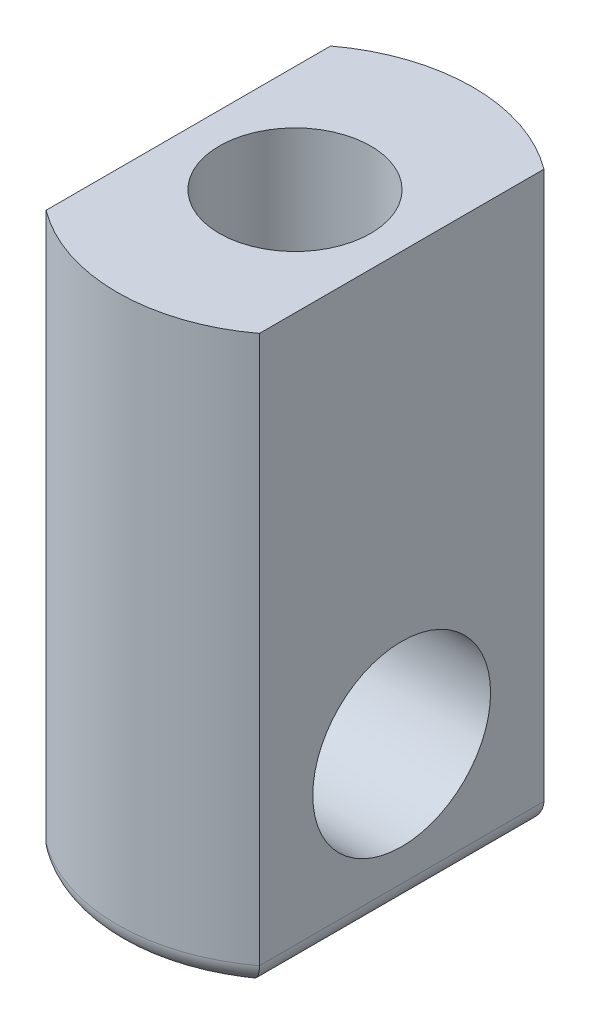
from build123d import *

# Parameters (mm, degrees)
SKETCH1_R                 = 3.175
ROD_DEPTH                 = 10.16
CUT_EXTRUDE1_DEPTH        = 10.16
SKETCH3_R                 = 1.5875
CUT_EXTRUDE2_DEPTH        = 12.305853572
F_6_32_TAPPED_HOLE1_D     = 2.7051
F_6_32_TAPPED_HOLE1_DEPTH = 6.858
F_6_32_TAPPED_HOLE1_TIP   = 0.81269403
FILLET1_R                 = 0.381


with BuildPart() as part:
    # Sketch1 → rod (new body)
    with BuildSketch(Plane(origin=(0, 0, 0), x_dir=(1, 0, 0), z_dir=(0, 1, 0))):
        with Locations(Location((0, 0, 0), (0, 0, 270))):
            Circle(SKETCH1_R)
    extrude(amount=ROD_DEPTH)

    # Sketch2 → Cut-Extrude1 (cut)
    with BuildSketch(Plane.XZ):
        with BuildLine():
            Line((-1.905, 2.54), (-1.905, -2.54))
            ThreePointArc((-1.905, -2.54), (-3.175, 0), (-1.905, 2.54))
        make_face()
        with BuildLine():
            Line((1.905, 2.54), (1.905, -2.54))
            ThreePointArc((1.905, -2.54), (3.175, 0), (1.905, 2.54))
        make_face()
    extrude(amount=-CUT_EXTRUDE1_DEPTH, mode=Mode.SUBTRACT)

    # Sketch3 → Cut-Extrude2 (cut, through all)
    with BuildSketch(Plane(origin=(1.905, 0, 0), x_dir=(0, 0, -1), z_dir=(1, 0, 0))):
        with Locations((0, 2.54)):
            Circle(SKETCH3_R)
    extrude(amount=-CUT_EXTRUDE2_DEPTH, mode=Mode.SUBTRACT)

    # 6-32 Tapped Hole1
    with Locations(Plane(origin=(0, 10.16, 0), x_dir=(1, 0, 0), z_dir=(0, 1, 0))):
        with Locations((0, 0)):
            Hole(F_6_32_TAPPED_HOLE1_D / 2, depth=F_6_32_TAPPED_HOLE1_DEPTH)
            with Locations((0, 0, -(F_6_32_TAPPED_HOLE1_DEPTH + F_6_32_TAPPED_HOLE1_TIP / 2))):  # 118° drill point
                Cone(0, F_6_32_TAPPED_HOLE1_D / 2, F_6_32_TAPPED_HOLE1_TIP, mode=Mode.SUBTRACT)

    # Fillet1
    fillet1_edges = [part.edges().sort_by_distance(p)[0] for p in [
        (-1.905, 0, 0),
        (1.905, 0, 0),
        (0, 0, -3.175),
        (0, 0, 3.175),
    ]]
    fillet(fillet1_edges, radius=FILLET1_R)


solid = part.part
